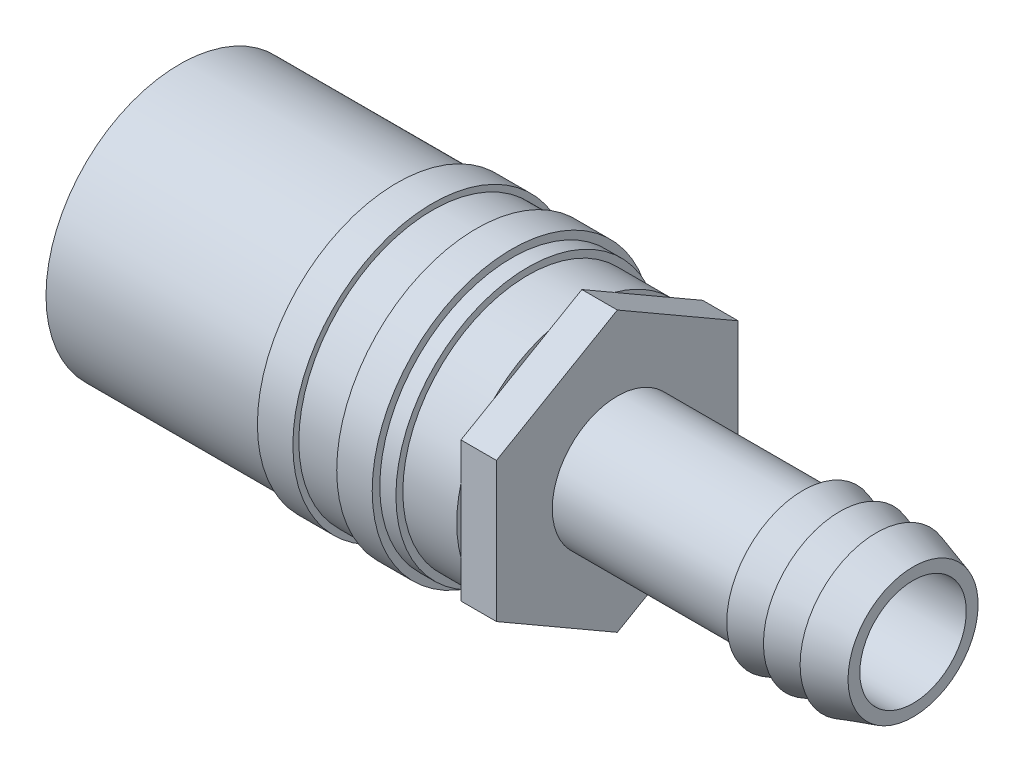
ISO-10303-21;
HEADER;
FILE_DESCRIPTION(('STEP AP214'),'2;1');
FILE_NAME('part.step','',(''),(''),'','','');
FILE_SCHEMA(('AUTOMOTIVE_DESIGN { 1 0 10303 214 1 1 1 1 }'));
ENDSEC;
DATA;
#1=APPLICATION_CONTEXT('core data for automotive mechanical design processes');
#2=APPLICATION_PROTOCOL_DEFINITION('international standard','automotive_design',2000,#1);
#3=PRODUCT_CONTEXT('',#1,'mechanical');
#4=PRODUCT('Part','Part','',(#3));
#5=PRODUCT_RELATED_PRODUCT_CATEGORY('part','',(#4));
#6=PRODUCT_DEFINITION_FORMATION('','',#4);
#7=PRODUCT_DEFINITION_CONTEXT('part definition',#1,'design');
#8=PRODUCT_DEFINITION('design','',#6,#7);
#9=PRODUCT_DEFINITION_SHAPE('','',#8);
#10=(LENGTH_UNIT() NAMED_UNIT(*) SI_UNIT(.MILLI.,.METRE.));
#11=(NAMED_UNIT(*) PLANE_ANGLE_UNIT() SI_UNIT($,.RADIAN.));
#12=(NAMED_UNIT(*) SI_UNIT($,.STERADIAN.) SOLID_ANGLE_UNIT());
#13=UNCERTAINTY_MEASURE_WITH_UNIT(LENGTH_MEASURE(1.E-05),#10,'distance_accuracy_value','');
#14=(GEOMETRIC_REPRESENTATION_CONTEXT(3) GLOBAL_UNCERTAINTY_ASSIGNED_CONTEXT((#13)) GLOBAL_UNIT_ASSIGNED_CONTEXT((#10,
#11,#12)) REPRESENTATION_CONTEXT('',''));
#15=CARTESIAN_POINT('',(0.,0.,0.));
#16=DIRECTION('',(0.,0.,1.));
#17=DIRECTION('',(1.,0.,0.));
#18=AXIS2_PLACEMENT_3D('',#15,#16,#17);
#19=CARTESIAN_POINT('',(34.,6.8,0.));
#20=DIRECTION('',(-1.,0.,0.));
#21=DIRECTION('',(0.,0.,1.));
#22=AXIS2_PLACEMENT_3D('',#19,#20,#21);
#23=PLANE('',#22);
#24=DIRECTION('',(0.,0.5,0.866025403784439));
#25=VECTOR('',#24,1.);
#26=CARTESIAN_POINT('',(34.,5.9,-10.2190997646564));
#27=LINE('',#26,#25);
#28=CARTESIAN_POINT('',(34.,7.48723073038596,-7.46993549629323));
#29=VERTEX_POINT('',#28);
#30=CARTESIAN_POINT('',(34.,10.212769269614,-2.74916426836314));
#31=VERTEX_POINT('',#30);
#32=EDGE_CURVE('P0_E10',#29,#31,#27,.T.);
#33=ORIENTED_EDGE('',*,*,#32,.F.);
#34=CARTESIAN_POINT('',(34.,0.,0.));
#35=DIRECTION('',(-1.,0.,0.));
#36=DIRECTION('',(0.,0.,1.));
#37=AXIS2_PLACEMENT_3D('',#34,#35,#36);
#38=CIRCLE('',#37,10.5763207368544);
#39=EDGE_CURVE('P0_E203',#31,#29,#38,.T.);
#40=ORIENTED_EDGE('',*,*,#39,.F.);
#41=EDGE_LOOP('',(#33,#40));
#42=FACE_BOUND('',#41,.T.);
#43=ADVANCED_FACE('P0_F16',(#42),#23,.F.);
#44=DIRECTION('',(0.,1.,0.));
#45=VECTOR('',#44,1.);
#46=CARTESIAN_POINT('',(34.,-5.9,-10.2190997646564));
#47=LINE('',#46,#45);
#48=CARTESIAN_POINT('',(34.,-2.72553853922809,-10.2190997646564));
#49=VERTEX_POINT('',#48);
#50=CARTESIAN_POINT('',(34.,2.72553853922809,-10.2190997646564));
#51=VERTEX_POINT('',#50);
#52=EDGE_CURVE('P0_E25',#49,#51,#47,.T.);
#53=ORIENTED_EDGE('',*,*,#52,.F.);
#54=EDGE_CURVE('P0_E197',#51,#49,#38,.T.);
#55=ORIENTED_EDGE('',*,*,#54,.F.);
#56=EDGE_LOOP('',(#53,#55));
#57=FACE_BOUND('',#56,.T.);
#58=ADVANCED_FACE('P0_F217',(#57),#23,.F.);
#59=DIRECTION('',(0.,0.5,-0.866025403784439));
#60=VECTOR('',#59,1.);
#61=CARTESIAN_POINT('',(34.,-11.8,0.));
#62=LINE('',#61,#60);
#63=CARTESIAN_POINT('',(34.,-10.212769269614,-2.74916426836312));
#64=VERTEX_POINT('',#63);
#65=CARTESIAN_POINT('',(34.,-7.48723073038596,-7.46993549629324));
#66=VERTEX_POINT('',#65);
#67=EDGE_CURVE('P0_E546',#64,#66,#62,.T.);
#68=ORIENTED_EDGE('',*,*,#67,.F.);
#69=EDGE_CURVE('P0_E191',#66,#64,#38,.T.);
#70=ORIENTED_EDGE('',*,*,#69,.F.);
#71=EDGE_LOOP('',(#68,#70));
#72=FACE_BOUND('',#71,.T.);
#73=ADVANCED_FACE('P0_F224',(#72),#23,.F.);
#74=DIRECTION('',(0.,-0.5,-0.866025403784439));
#75=VECTOR('',#74,1.);
#76=CARTESIAN_POINT('',(34.,-5.9,10.2190997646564));
#77=LINE('',#76,#75);
#78=CARTESIAN_POINT('',(34.,-7.48723073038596,7.46993549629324));
#79=VERTEX_POINT('',#78);
#80=CARTESIAN_POINT('',(34.,-10.212769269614,2.74916426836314));
#81=VERTEX_POINT('',#80);
#82=EDGE_CURVE('P0_E41',#79,#81,#77,.T.);
#83=ORIENTED_EDGE('',*,*,#82,.F.);
#84=EDGE_CURVE('P0_E186',#81,#79,#38,.T.);
#85=ORIENTED_EDGE('',*,*,#84,.F.);
#86=EDGE_LOOP('',(#83,#85));
#87=FACE_BOUND('',#86,.T.);
#88=ADVANCED_FACE('P0_F236',(#87),#23,.F.);
#89=DIRECTION('',(0.,-1.,0.));
#90=VECTOR('',#89,1.);
#91=CARTESIAN_POINT('',(34.,5.9,10.2190997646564));
#92=LINE('',#91,#90);
#93=CARTESIAN_POINT('',(34.,2.72553853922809,10.2190997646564));
#94=VERTEX_POINT('',#93);
#95=CARTESIAN_POINT('',(34.,-2.72553853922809,10.2190997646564));
#96=VERTEX_POINT('',#95);
#97=EDGE_CURVE('P0_E239',#94,#96,#92,.T.);
#98=ORIENTED_EDGE('',*,*,#97,.F.);
#99=EDGE_CURVE('P0_E34',#96,#94,#38,.T.);
#100=ORIENTED_EDGE('',*,*,#99,.F.);
#101=EDGE_LOOP('',(#98,#100));
#102=FACE_BOUND('',#101,.T.);
#103=ADVANCED_FACE('P0_F228',(#102),#23,.F.);
#104=DIRECTION('',(0.,-0.5,0.866025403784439));
#105=VECTOR('',#104,1.);
#106=CARTESIAN_POINT('',(34.,11.8,0.));
#107=LINE('',#106,#105);
#108=CARTESIAN_POINT('',(34.,10.212769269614,2.74916426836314));
#109=VERTEX_POINT('',#108);
#110=CARTESIAN_POINT('',(34.,7.48723073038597,7.46993549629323));
#111=VERTEX_POINT('',#110);
#112=EDGE_CURVE('P0_E183',#109,#111,#107,.T.);
#113=ORIENTED_EDGE('',*,*,#112,.F.);
#114=EDGE_CURVE('P0_E177',#111,#109,#38,.T.);
#115=ORIENTED_EDGE('',*,*,#114,.F.);
#116=EDGE_LOOP('',(#113,#115));
#117=FACE_BOUND('',#116,.T.);
#118=ADVANCED_FACE('P0_F218',(#117),#23,.F.);
#119=CARTESIAN_POINT('',(0.,0.,0.));
#120=DIRECTION('',(-1.,0.,0.));
#121=DIRECTION('',(0.,0.,1.));
#122=AXIS2_PLACEMENT_3D('',#119,#120,#121);
#123=CYLINDRICAL_SURFACE('',#122,6.8);
#124=CARTESIAN_POINT('',(34.,0.,0.));
#125=DIRECTION('',(-1.,0.,0.));
#126=DIRECTION('',(0.,0.,1.));
#127=AXIS2_PLACEMENT_3D('',#124,#125,#126);
#128=CIRCLE('',#127,6.8);
#129=CARTESIAN_POINT('',(34.,0.,6.8));
#130=VERTEX_POINT('',#129);
#131=EDGE_CURVE('P0_E20',#130,#130,#128,.T.);
#132=ORIENTED_EDGE('',*,*,#131,.F.);
#133=EDGE_LOOP('',(#132));
#134=FACE_BOUND('',#133,.T.);
#135=CARTESIAN_POINT('',(0.,0.,0.));
#136=DIRECTION('',(-1.,0.,0.));
#137=DIRECTION('',(0.,0.,1.));
#138=AXIS2_PLACEMENT_3D('',#135,#136,#137);
#139=CIRCLE('',#138,6.8);
#140=CARTESIAN_POINT('',(0.,0.,6.8));
#141=VERTEX_POINT('',#140);
#142=EDGE_CURVE('P0_E136',#141,#141,#139,.T.);
#143=ORIENTED_EDGE('',*,*,#142,.T.);
#144=EDGE_LOOP('',(#143));
#145=FACE_BOUND('',#144,.T.);
#146=ADVANCED_FACE('P0_F18',(#134,#145),#123,.F.);
#147=CARTESIAN_POINT('',(0.,0.,0.));
#148=DIRECTION('',(-1.,0.,0.));
#149=DIRECTION('',(0.,0.,1.));
#150=AXIS2_PLACEMENT_3D('',#147,#148,#149);
#151=CYLINDRICAL_SURFACE('',#150,10.5763207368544);
#152=CARTESIAN_POINT('',(29.4406853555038,0.,0.));
#153=DIRECTION('',(-1.,0.,0.));
#154=DIRECTION('',(0.,0.,1.));
#155=AXIS2_PLACEMENT_3D('',#152,#153,#154);
#156=CIRCLE('',#155,10.5763207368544);
#157=CARTESIAN_POINT('',(29.4406853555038,0.,10.5763207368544));
#158=VERTEX_POINT('',#157);
#159=EDGE_CURVE('P0_E174',#158,#158,#156,.T.);
#160=ORIENTED_EDGE('',*,*,#159,.F.);
#161=EDGE_LOOP('',(#160));
#162=FACE_BOUND('',#161,.T.);
#163=EDGE_CURVE('P0_E176',#94,#111,#38,.T.);
#164=ORIENTED_EDGE('',*,*,#163,.T.);
#165=ORIENTED_EDGE('',*,*,#114,.T.);
#166=EDGE_CURVE('P0_E184',#109,#31,#38,.T.);
#167=ORIENTED_EDGE('',*,*,#166,.T.);
#168=ORIENTED_EDGE('',*,*,#39,.T.);
#169=EDGE_CURVE('P0_E201',#29,#51,#38,.T.);
#170=ORIENTED_EDGE('',*,*,#169,.T.);
#171=ORIENTED_EDGE('',*,*,#54,.T.);
#172=EDGE_CURVE('P0_E195',#49,#66,#38,.T.);
#173=ORIENTED_EDGE('',*,*,#172,.T.);
#174=ORIENTED_EDGE('',*,*,#69,.T.);
#175=EDGE_CURVE('P0_E189',#64,#81,#38,.T.);
#176=ORIENTED_EDGE('',*,*,#175,.T.);
#177=ORIENTED_EDGE('',*,*,#84,.T.);
#178=EDGE_CURVE('P0_E185',#79,#96,#38,.T.);
#179=ORIENTED_EDGE('',*,*,#178,.T.);
#180=ORIENTED_EDGE('',*,*,#99,.T.);
#181=EDGE_LOOP('',(#164,#165,#167,#168,#170,#171,#173,#174,#176,#177,#179,#180));
#182=FACE_BOUND('',#181,.T.);
#183=ADVANCED_FACE('P0_F209',(#162,#182),#151,.T.);
#184=CARTESIAN_POINT('',(29.4406853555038,11.1600845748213,0.));
#185=DIRECTION('',(-1.,0.,0.));
#186=DIRECTION('',(0.,0.,1.));
#187=AXIS2_PLACEMENT_3D('',#184,#185,#186);
#188=PLANE('',#187);
#189=CARTESIAN_POINT('',(29.4406853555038,0.,0.));
#190=DIRECTION('',(-1.,0.,0.));
#191=DIRECTION('',(0.,0.,1.));
#192=AXIS2_PLACEMENT_3D('',#189,#190,#191);
#193=CIRCLE('',#192,11.1600845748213);
#194=CARTESIAN_POINT('',(29.4406853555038,0.,11.1600845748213));
#195=VERTEX_POINT('',#194);
#196=EDGE_CURVE('P0_E171',#195,#195,#193,.T.);
#197=ORIENTED_EDGE('',*,*,#196,.F.);
#198=EDGE_LOOP('',(#197));
#199=FACE_BOUND('',#198,.T.);
#200=ORIENTED_EDGE('',*,*,#159,.T.);
#201=EDGE_LOOP('',(#200));
#202=FACE_BOUND('',#201,.T.);
#203=ADVANCED_FACE('P0_F337',(#199,#202),#188,.F.);
#204=CARTESIAN_POINT('',(0.,0.,0.));
#205=DIRECTION('',(-1.,0.,0.));
#206=DIRECTION('',(0.,0.,1.));
#207=AXIS2_PLACEMENT_3D('',#204,#205,#206);
#208=CYLINDRICAL_SURFACE('',#207,11.1600845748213);
#209=CARTESIAN_POINT('',(28.0769611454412,0.,0.));
#210=DIRECTION('',(-1.,0.,0.));
#211=DIRECTION('',(0.,0.,1.));
#212=AXIS2_PLACEMENT_3D('',#209,#210,#211);
#213=CIRCLE('',#212,11.1600845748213);
#214=CARTESIAN_POINT('',(28.0769611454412,0.,11.1600845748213));
#215=VERTEX_POINT('',#214);
#216=EDGE_CURVE('P0_E168',#215,#215,#213,.T.);
#217=ORIENTED_EDGE('',*,*,#216,.F.);
#218=EDGE_LOOP('',(#217));
#219=FACE_BOUND('',#218,.T.);
#220=ORIENTED_EDGE('',*,*,#196,.T.);
#221=EDGE_LOOP('',(#220));
#222=FACE_BOUND('',#221,.T.);
#223=ADVANCED_FACE('P0_F333',(#219,#222),#208,.T.);
#224=CARTESIAN_POINT('',(28.0769611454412,11.8,0.));
#225=DIRECTION('',(-1.,0.,0.));
#226=DIRECTION('',(0.,0.,1.));
#227=AXIS2_PLACEMENT_3D('',#224,#225,#226);
#228=PLANE('',#227);
#229=CARTESIAN_POINT('',(28.0769611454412,0.,0.));
#230=DIRECTION('',(-1.,0.,0.));
#231=DIRECTION('',(0.,0.,1.));
#232=AXIS2_PLACEMENT_3D('',#229,#230,#231);
#233=CIRCLE('',#232,11.8);
#234=CARTESIAN_POINT('',(28.0769611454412,0.,11.8));
#235=VERTEX_POINT('',#234);
#236=EDGE_CURVE('P0_E165',#235,#235,#233,.T.);
#237=ORIENTED_EDGE('',*,*,#236,.F.);
#238=EDGE_LOOP('',(#237));
#239=FACE_BOUND('',#238,.T.);
#240=ORIENTED_EDGE('',*,*,#216,.T.);
#241=EDGE_LOOP('',(#240));
#242=FACE_BOUND('',#241,.T.);
#243=ADVANCED_FACE('P0_F329',(#239,#242),#228,.F.);
#244=CARTESIAN_POINT('',(0.,0.,0.));
#245=DIRECTION('',(-1.,0.,0.));
#246=DIRECTION('',(0.,0.,1.));
#247=AXIS2_PLACEMENT_3D('',#244,#245,#246);
#248=CYLINDRICAL_SURFACE('',#247,11.8);
#249=CARTESIAN_POINT('',(25.0769611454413,0.,0.));
#250=DIRECTION('',(-1.,0.,0.));
#251=DIRECTION('',(0.,0.,1.));
#252=AXIS2_PLACEMENT_3D('',#249,#250,#251);
#253=CIRCLE('',#252,11.8);
#254=CARTESIAN_POINT('',(25.0769611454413,0.,11.8));
#255=VERTEX_POINT('',#254);
#256=EDGE_CURVE('P0_E162',#255,#255,#253,.T.);
#257=ORIENTED_EDGE('',*,*,#256,.F.);
#258=EDGE_LOOP('',(#257));
#259=FACE_BOUND('',#258,.T.);
#260=ORIENTED_EDGE('',*,*,#236,.T.);
#261=EDGE_LOOP('',(#260));
#262=FACE_BOUND('',#261,.T.);
#263=ADVANCED_FACE('P0_F325',(#259,#262),#248,.T.);
#264=CARTESIAN_POINT('',(25.0769611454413,11.3,0.));
#265=DIRECTION('',(1.,0.,0.));
#266=DIRECTION('',(0.,0.,-1.));
#267=AXIS2_PLACEMENT_3D('',#264,#265,#266);
#268=PLANE('',#267);
#269=CARTESIAN_POINT('',(25.0769611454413,0.,0.));
#270=DIRECTION('',(-1.,0.,0.));
#271=DIRECTION('',(0.,0.,1.));
#272=AXIS2_PLACEMENT_3D('',#269,#270,#271);
#273=CIRCLE('',#272,11.3);
#274=CARTESIAN_POINT('',(25.0769611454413,0.,11.3));
#275=VERTEX_POINT('',#274);
#276=EDGE_CURVE('P0_E159',#275,#275,#273,.T.);
#277=ORIENTED_EDGE('',*,*,#276,.F.);
#278=EDGE_LOOP('',(#277));
#279=FACE_BOUND('',#278,.T.);
#280=ORIENTED_EDGE('',*,*,#256,.T.);
#281=EDGE_LOOP('',(#280));
#282=FACE_BOUND('',#281,.T.);
#283=ADVANCED_FACE('P0_F321',(#279,#282),#268,.F.);
#284=CARTESIAN_POINT('',(0.,0.,0.));
#285=DIRECTION('',(-1.,0.,0.));
#286=DIRECTION('',(0.,0.,1.));
#287=AXIS2_PLACEMENT_3D('',#284,#285,#286);
#288=CYLINDRICAL_SURFACE('',#287,11.3);
#289=CARTESIAN_POINT('',(21.3716105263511,0.,0.));
#290=DIRECTION('',(-1.,0.,0.));
#291=DIRECTION('',(0.,0.,1.));
#292=AXIS2_PLACEMENT_3D('',#289,#290,#291);
#293=CIRCLE('',#292,11.3);
#294=CARTESIAN_POINT('',(21.3716105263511,0.,11.3));
#295=VERTEX_POINT('',#294);
#296=EDGE_CURVE('P0_E156',#295,#295,#293,.T.);
#297=ORIENTED_EDGE('',*,*,#296,.F.);
#298=EDGE_LOOP('',(#297));
#299=FACE_BOUND('',#298,.T.);
#300=ORIENTED_EDGE('',*,*,#276,.T.);
#301=EDGE_LOOP('',(#300));
#302=FACE_BOUND('',#301,.T.);
#303=ADVANCED_FACE('P0_F317',(#299,#302),#288,.T.);
#304=CARTESIAN_POINT('',(21.3716105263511,11.8,0.));
#305=DIRECTION('',(-1.,0.,0.));
#306=DIRECTION('',(0.,0.,1.));
#307=AXIS2_PLACEMENT_3D('',#304,#305,#306);
#308=PLANE('',#307);
#309=CARTESIAN_POINT('',(21.3716105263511,0.,0.));
#310=DIRECTION('',(-1.,0.,0.));
#311=DIRECTION('',(0.,0.,1.));
#312=AXIS2_PLACEMENT_3D('',#309,#310,#311);
#313=CIRCLE('',#312,11.8);
#314=CARTESIAN_POINT('',(21.3716105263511,0.,11.8));
#315=VERTEX_POINT('',#314);
#316=EDGE_CURVE('P0_E153',#315,#315,#313,.T.);
#317=ORIENTED_EDGE('',*,*,#316,.F.);
#318=EDGE_LOOP('',(#317));
#319=FACE_BOUND('',#318,.T.);
#320=ORIENTED_EDGE('',*,*,#296,.T.);
#321=EDGE_LOOP('',(#320));
#322=FACE_BOUND('',#321,.T.);
#323=ADVANCED_FACE('P0_F313',(#319,#322),#308,.F.);
#324=CARTESIAN_POINT('',(0.,0.,0.));
#325=DIRECTION('',(-1.,0.,0.));
#326=DIRECTION('',(0.,0.,1.));
#327=AXIS2_PLACEMENT_3D('',#324,#325,#326);
#328=CYLINDRICAL_SURFACE('',#327,11.8);
#329=CARTESIAN_POINT('',(18.3716105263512,0.,0.));
#330=DIRECTION('',(-1.,0.,0.));
#331=DIRECTION('',(0.,0.,1.));
#332=AXIS2_PLACEMENT_3D('',#329,#330,#331);
#333=CIRCLE('',#332,11.8);
#334=CARTESIAN_POINT('',(18.3716105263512,0.,11.8));
#335=VERTEX_POINT('',#334);
#336=EDGE_CURVE('P0_E150',#335,#335,#333,.T.);
#337=ORIENTED_EDGE('',*,*,#336,.F.);
#338=EDGE_LOOP('',(#337));
#339=FACE_BOUND('',#338,.T.);
#340=ORIENTED_EDGE('',*,*,#316,.T.);
#341=EDGE_LOOP('',(#340));
#342=FACE_BOUND('',#341,.T.);
#343=ADVANCED_FACE('P0_F309',(#339,#342),#328,.T.);
#344=CARTESIAN_POINT('',(18.3716105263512,11.3,0.));
#345=DIRECTION('',(1.,0.,0.));
#346=DIRECTION('',(0.,0.,-1.));
#347=AXIS2_PLACEMENT_3D('',#344,#345,#346);
#348=PLANE('',#347);
#349=CARTESIAN_POINT('',(18.3716105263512,0.,0.));
#350=DIRECTION('',(-1.,0.,0.));
#351=DIRECTION('',(0.,0.,1.));
#352=AXIS2_PLACEMENT_3D('',#349,#350,#351);
#353=CIRCLE('',#352,11.3);
#354=CARTESIAN_POINT('',(18.3716105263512,0.,11.3));
#355=VERTEX_POINT('',#354);
#356=EDGE_CURVE('P0_E147',#355,#355,#353,.T.);
#357=ORIENTED_EDGE('',*,*,#356,.F.);
#358=EDGE_LOOP('',(#357));
#359=FACE_BOUND('',#358,.T.);
#360=ORIENTED_EDGE('',*,*,#336,.T.);
#361=EDGE_LOOP('',(#360));
#362=FACE_BOUND('',#361,.T.);
#363=ADVANCED_FACE('P0_F305',(#359,#362),#348,.F.);
#364=CARTESIAN_POINT('',(0.,0.,0.));
#365=DIRECTION('',(-1.,0.,0.));
#366=DIRECTION('',(0.,0.,1.));
#367=AXIS2_PLACEMENT_3D('',#364,#365,#366);
#368=CYLINDRICAL_SURFACE('',#367,11.3);
#369=CARTESIAN_POINT('',(0.,0.,0.));
#370=DIRECTION('',(-1.,0.,0.));
#371=DIRECTION('',(0.,0.,1.));
#372=AXIS2_PLACEMENT_3D('',#369,#370,#371);
#373=CIRCLE('',#372,11.3);
#374=CARTESIAN_POINT('',(0.,0.,11.3));
#375=VERTEX_POINT('',#374);
#376=EDGE_CURVE('P0_E139',#375,#375,#373,.T.);
#377=ORIENTED_EDGE('',*,*,#376,.F.);
#378=EDGE_LOOP('',(#377));
#379=FACE_BOUND('',#378,.T.);
#380=ORIENTED_EDGE('',*,*,#356,.T.);
#381=EDGE_LOOP('',(#380));
#382=FACE_BOUND('',#381,.T.);
#383=ADVANCED_FACE('P0_F301',(#379,#382),#368,.T.);
#384=CARTESIAN_POINT('',(0.,6.8,0.));
#385=DIRECTION('',(1.,0.,0.));
#386=DIRECTION('',(0.,0.,-1.));
#387=AXIS2_PLACEMENT_3D('',#384,#385,#386);
#388=PLANE('',#387);
#389=ORIENTED_EDGE('',*,*,#142,.F.);
#390=EDGE_LOOP('',(#389));
#391=FACE_BOUND('',#390,.T.);
#392=ORIENTED_EDGE('',*,*,#376,.T.);
#393=EDGE_LOOP('',(#392));
#394=FACE_BOUND('',#393,.T.);
#395=ADVANCED_FACE('P0_F298',(#391,#394),#388,.F.);
#396=CARTESIAN_POINT('',(34.,0.,0.));
#397=DIRECTION('',(1.,0.,0.));
#398=DIRECTION('',(0.,0.,-1.));
#399=AXIS2_PLACEMENT_3D('',#396,#397,#398);
#400=PLANE('',#399);
#401=ORIENTED_EDGE('',*,*,#163,.F.);
#402=CARTESIAN_POINT('',(34.,5.9,10.2190997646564));
#403=VERTEX_POINT('',#402);
#404=EDGE_CURVE('P0_E244',#403,#94,#92,.T.);
#405=ORIENTED_EDGE('',*,*,#404,.F.);
#406=EDGE_CURVE('P0_E241',#111,#403,#107,.T.);
#407=ORIENTED_EDGE('',*,*,#406,.F.);
#408=EDGE_LOOP('',(#401,#405,#407));
#409=FACE_BOUND('',#408,.T.);
#410=ADVANCED_FACE('P0_F273',(#409),#400,.F.);
#411=ORIENTED_EDGE('',*,*,#166,.F.);
#412=CARTESIAN_POINT('',(34.,11.8,0.));
#413=VERTEX_POINT('',#412);
#414=EDGE_CURVE('P0_E212',#413,#109,#107,.T.);
#415=ORIENTED_EDGE('',*,*,#414,.F.);
#416=EDGE_CURVE('P0_E28',#31,#413,#27,.T.);
#417=ORIENTED_EDGE('',*,*,#416,.F.);
#418=EDGE_LOOP('',(#411,#415,#417));
#419=FACE_BOUND('',#418,.T.);
#420=ADVANCED_FACE('P0_F211',(#419),#400,.F.);
#421=ORIENTED_EDGE('',*,*,#169,.F.);
#422=CARTESIAN_POINT('',(34.,5.9,-10.2190997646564));
#423=VERTEX_POINT('',#422);
#424=EDGE_CURVE('P0_E27',#423,#29,#27,.T.);
#425=ORIENTED_EDGE('',*,*,#424,.F.);
#426=EDGE_CURVE('P0_E553',#51,#423,#47,.T.);
#427=ORIENTED_EDGE('',*,*,#426,.F.);
#428=EDGE_LOOP('',(#421,#425,#427));
#429=FACE_BOUND('',#428,.T.);
#430=ADVANCED_FACE('P0_F424',(#429),#400,.F.);
#431=ORIENTED_EDGE('',*,*,#172,.F.);
#432=CARTESIAN_POINT('',(34.,-5.9,-10.2190997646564));
#433=VERTEX_POINT('',#432);
#434=EDGE_CURVE('P0_E130',#433,#49,#47,.T.);
#435=ORIENTED_EDGE('',*,*,#434,.F.);
#436=EDGE_CURVE('P0_E550',#66,#433,#62,.T.);
#437=ORIENTED_EDGE('',*,*,#436,.F.);
#438=EDGE_LOOP('',(#431,#435,#437));
#439=FACE_BOUND('',#438,.T.);
#440=ADVANCED_FACE('P0_F431',(#439),#400,.F.);
#441=ORIENTED_EDGE('',*,*,#175,.F.);
#442=CARTESIAN_POINT('',(34.,-11.8,0.));
#443=VERTEX_POINT('',#442);
#444=EDGE_CURVE('P0_E549',#443,#64,#62,.T.);
#445=ORIENTED_EDGE('',*,*,#444,.F.);
#446=EDGE_CURVE('P0_E556',#81,#443,#77,.T.);
#447=ORIENTED_EDGE('',*,*,#446,.F.);
#448=EDGE_LOOP('',(#441,#445,#447));
#449=FACE_BOUND('',#448,.T.);
#450=ADVANCED_FACE('P0_F274',(#449),#400,.F.);
#451=CARTESIAN_POINT('',(34.,0.,0.));
#452=DIRECTION('',(1.,0.,0.));
#453=DIRECTION('',(0.,0.,-1.));
#454=AXIS2_PLACEMENT_3D('',#451,#452,#453);
#455=CIRCLE('',#454,4.75);
#456=CARTESIAN_POINT('',(34.,0.,-4.75));
#457=VERTEX_POINT('',#456);
#458=EDGE_CURVE('P0_E254',#457,#457,#455,.T.);
#459=ORIENTED_EDGE('',*,*,#458,.T.);
#460=EDGE_LOOP('',(#459));
#461=FACE_BOUND('',#460,.T.);
#462=ORIENTED_EDGE('',*,*,#131,.T.);
#463=EDGE_LOOP('',(#462));
#464=FACE_BOUND('',#463,.T.);
#465=ADVANCED_FACE('P0_F264',(#461,#464),#400,.F.);
#466=CARTESIAN_POINT('',(37.,0.,0.));
#467=DIRECTION('',(1.,0.,0.));
#468=DIRECTION('',(0.,0.,-1.));
#469=AXIS2_PLACEMENT_3D('',#466,#467,#468);
#470=PLANE('',#469);
#471=DIRECTION('',(0.,0.5,0.866025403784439));
#472=VECTOR('',#471,1.);
#473=CARTESIAN_POINT('',(37.,5.9,-10.2190997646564));
#474=LINE('',#473,#472);
#475=CARTESIAN_POINT('',(37.,5.9,-10.2190997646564));
#476=VERTEX_POINT('',#475);
#477=CARTESIAN_POINT('',(37.,11.8,0.));
#478=VERTEX_POINT('',#477);
#479=EDGE_CURVE('P0_E120',#476,#478,#474,.T.);
#480=ORIENTED_EDGE('',*,*,#479,.T.);
#481=DIRECTION('',(0.,-0.5,0.866025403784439));
#482=VECTOR('',#481,1.);
#483=CARTESIAN_POINT('',(37.,11.8,0.));
#484=LINE('',#483,#482);
#485=CARTESIAN_POINT('',(37.,5.9,10.2190997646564));
#486=VERTEX_POINT('',#485);
#487=EDGE_CURVE('P0_E109',#478,#486,#484,.T.);
#488=ORIENTED_EDGE('',*,*,#487,.T.);
#489=DIRECTION('',(0.,-1.,0.));
#490=VECTOR('',#489,1.);
#491=CARTESIAN_POINT('',(37.,5.9,10.2190997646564));
#492=LINE('',#491,#490);
#493=CARTESIAN_POINT('',(37.,-5.9,10.2190997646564));
#494=VERTEX_POINT('',#493);
#495=EDGE_CURVE('P0_E119',#486,#494,#492,.T.);
#496=ORIENTED_EDGE('',*,*,#495,.T.);
#497=DIRECTION('',(0.,-0.5,-0.866025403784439));
#498=VECTOR('',#497,1.);
#499=CARTESIAN_POINT('',(37.,-5.9,10.2190997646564));
#500=LINE('',#499,#498);
#501=CARTESIAN_POINT('',(37.,-11.8,0.));
#502=VERTEX_POINT('',#501);
#503=EDGE_CURVE('P0_E251',#494,#502,#500,.T.);
#504=ORIENTED_EDGE('',*,*,#503,.T.);
#505=DIRECTION('',(0.,0.5,-0.866025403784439));
#506=VECTOR('',#505,1.);
#507=CARTESIAN_POINT('',(37.,-11.8,0.));
#508=LINE('',#507,#506);
#509=CARTESIAN_POINT('',(37.,-5.9,-10.2190997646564));
#510=VERTEX_POINT('',#509);
#511=EDGE_CURVE('P0_E249',#502,#510,#508,.T.);
#512=ORIENTED_EDGE('',*,*,#511,.T.);
#513=DIRECTION('',(0.,1.,0.));
#514=VECTOR('',#513,1.);
#515=CARTESIAN_POINT('',(37.,-5.9,-10.2190997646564));
#516=LINE('',#515,#514);
#517=EDGE_CURVE('P0_E126',#510,#476,#516,.T.);
#518=ORIENTED_EDGE('',*,*,#517,.T.);
#519=EDGE_LOOP('',(#480,#488,#496,#504,#512,#518));
#520=FACE_BOUND('',#519,.T.);
#521=CARTESIAN_POINT('',(37.,0.,0.));
#522=DIRECTION('',(1.,0.,0.));
#523=DIRECTION('',(0.,0.,-1.));
#524=AXIS2_PLACEMENT_3D('',#521,#522,#523);
#525=CIRCLE('',#524,4.75);
#526=CARTESIAN_POINT('',(37.,0.,-4.75));
#527=VERTEX_POINT('',#526);
#528=EDGE_CURVE('P0_E213',#527,#527,#525,.T.);
#529=ORIENTED_EDGE('',*,*,#528,.F.);
#530=EDGE_LOOP('',(#529));
#531=FACE_BOUND('',#530,.T.);
#532=ADVANCED_FACE('P0_F123',(#520,#531),#470,.T.);
#533=ORIENTED_EDGE('',*,*,#178,.F.);
#534=CARTESIAN_POINT('',(34.,-5.9,10.2190997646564));
#535=VERTEX_POINT('',#534);
#536=EDGE_CURVE('P0_E555',#535,#79,#77,.T.);
#537=ORIENTED_EDGE('',*,*,#536,.F.);
#538=EDGE_CURVE('P0_E245',#96,#535,#92,.T.);
#539=ORIENTED_EDGE('',*,*,#538,.F.);
#540=EDGE_LOOP('',(#533,#537,#539));
#541=FACE_BOUND('',#540,.T.);
#542=ADVANCED_FACE('P0_F263',(#541),#400,.F.);
#543=CARTESIAN_POINT('',(37.,5.9,-10.2190997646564));
#544=DIRECTION('',(0.,-0.866025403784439,0.5));
#545=DIRECTION('',(0.,-0.5,-0.866025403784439));
#546=AXIS2_PLACEMENT_3D('',#543,#544,#545);
#547=PLANE('',#546);
#548=ORIENTED_EDGE('',*,*,#424,.T.);
#549=ORIENTED_EDGE('',*,*,#32,.T.);
#550=ORIENTED_EDGE('',*,*,#416,.T.);
#551=DIRECTION('',(-1.,0.,0.));
#552=VECTOR('',#551,1.);
#553=CARTESIAN_POINT('',(37.,11.8,0.));
#554=LINE('',#553,#552);
#555=EDGE_CURVE('P0_E114',#478,#413,#554,.T.);
#556=ORIENTED_EDGE('',*,*,#555,.F.);
#557=ORIENTED_EDGE('',*,*,#479,.F.);
#558=DIRECTION('',(-1.,0.,0.));
#559=VECTOR('',#558,1.);
#560=CARTESIAN_POINT('',(37.,5.9,-10.2190997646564));
#561=LINE('',#560,#559);
#562=EDGE_CURVE('P0_E248',#476,#423,#561,.T.);
#563=ORIENTED_EDGE('',*,*,#562,.T.);
#564=EDGE_LOOP('',(#548,#549,#550,#556,#557,#563));
#565=FACE_BOUND('',#564,.T.);
#566=ADVANCED_FACE('P0_F133',(#565),#547,.F.);
#567=CARTESIAN_POINT('',(37.,11.8,0.));
#568=DIRECTION('',(0.,-0.866025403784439,-0.5));
#569=DIRECTION('',(0.,0.5,-0.866025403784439));
#570=AXIS2_PLACEMENT_3D('',#567,#568,#569);
#571=PLANE('',#570);
#572=ORIENTED_EDGE('',*,*,#414,.T.);
#573=ORIENTED_EDGE('',*,*,#112,.T.);
#574=ORIENTED_EDGE('',*,*,#406,.T.);
#575=DIRECTION('',(-1.,0.,0.));
#576=VECTOR('',#575,1.);
#577=CARTESIAN_POINT('',(37.,5.9,10.2190997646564));
#578=LINE('',#577,#576);
#579=EDGE_CURVE('P0_E116',#486,#403,#578,.T.);
#580=ORIENTED_EDGE('',*,*,#579,.F.);
#581=ORIENTED_EDGE('',*,*,#487,.F.);
#582=ORIENTED_EDGE('',*,*,#555,.T.);
#583=EDGE_LOOP('',(#572,#573,#574,#580,#581,#582));
#584=FACE_BOUND('',#583,.T.);
#585=ADVANCED_FACE('P0_F112',(#584),#571,.F.);
#586=CARTESIAN_POINT('',(37.,5.9,10.2190997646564));
#587=DIRECTION('',(0.,0.,-1.));
#588=DIRECTION('',(-1.,0.,0.));
#589=AXIS2_PLACEMENT_3D('',#586,#587,#588);
#590=PLANE('',#589);
#591=ORIENTED_EDGE('',*,*,#404,.T.);
#592=ORIENTED_EDGE('',*,*,#97,.T.);
#593=ORIENTED_EDGE('',*,*,#538,.T.);
#594=DIRECTION('',(-1.,0.,0.));
#595=VECTOR('',#594,1.);
#596=CARTESIAN_POINT('',(37.,-5.9,10.2190997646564));
#597=LINE('',#596,#595);
#598=EDGE_CURVE('P0_E141',#494,#535,#597,.T.);
#599=ORIENTED_EDGE('',*,*,#598,.F.);
#600=ORIENTED_EDGE('',*,*,#495,.F.);
#601=ORIENTED_EDGE('',*,*,#579,.T.);
#602=EDGE_LOOP('',(#591,#592,#593,#599,#600,#601));
#603=FACE_BOUND('',#602,.T.);
#604=ADVANCED_FACE('P0_F289',(#603),#590,.F.);
#605=CARTESIAN_POINT('',(37.,-5.9,10.2190997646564));
#606=DIRECTION('',(0.,0.866025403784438,-0.5));
#607=DIRECTION('',(0.,0.5,0.866025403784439));
#608=AXIS2_PLACEMENT_3D('',#605,#606,#607);
#609=PLANE('',#608);
#610=ORIENTED_EDGE('',*,*,#536,.T.);
#611=ORIENTED_EDGE('',*,*,#82,.T.);
#612=ORIENTED_EDGE('',*,*,#446,.T.);
#613=DIRECTION('',(-1.,0.,0.));
#614=VECTOR('',#613,1.);
#615=CARTESIAN_POINT('',(37.,-11.8,0.));
#616=LINE('',#615,#614);
#617=EDGE_CURVE('P0_E567',#502,#443,#616,.T.);
#618=ORIENTED_EDGE('',*,*,#617,.F.);
#619=ORIENTED_EDGE('',*,*,#503,.F.);
#620=ORIENTED_EDGE('',*,*,#598,.T.);
#621=EDGE_LOOP('',(#610,#611,#612,#618,#619,#620));
#622=FACE_BOUND('',#621,.T.);
#623=ADVANCED_FACE('P0_F285',(#622),#609,.F.);
#624=CARTESIAN_POINT('',(37.,-11.8,0.));
#625=DIRECTION('',(0.,0.866025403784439,0.5));
#626=DIRECTION('',(0.,-0.5,0.866025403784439));
#627=AXIS2_PLACEMENT_3D('',#624,#625,#626);
#628=PLANE('',#627);
#629=ORIENTED_EDGE('',*,*,#444,.T.);
#630=ORIENTED_EDGE('',*,*,#67,.T.);
#631=ORIENTED_EDGE('',*,*,#436,.T.);
#632=DIRECTION('',(-1.,0.,0.));
#633=VECTOR('',#632,1.);
#634=CARTESIAN_POINT('',(37.,-5.9,-10.2190997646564));
#635=LINE('',#634,#633);
#636=EDGE_CURVE('P0_E569',#510,#433,#635,.T.);
#637=ORIENTED_EDGE('',*,*,#636,.F.);
#638=ORIENTED_EDGE('',*,*,#511,.F.);
#639=ORIENTED_EDGE('',*,*,#617,.T.);
#640=EDGE_LOOP('',(#629,#630,#631,#637,#638,#639));
#641=FACE_BOUND('',#640,.T.);
#642=ADVANCED_FACE('P0_F281',(#641),#628,.F.);
#643=CARTESIAN_POINT('',(37.,-5.9,-10.2190997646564));
#644=DIRECTION('',(0.,0.,1.));
#645=DIRECTION('',(1.,0.,0.));
#646=AXIS2_PLACEMENT_3D('',#643,#644,#645);
#647=PLANE('',#646);
#648=ORIENTED_EDGE('',*,*,#434,.T.);
#649=ORIENTED_EDGE('',*,*,#52,.T.);
#650=ORIENTED_EDGE('',*,*,#426,.T.);
#651=ORIENTED_EDGE('',*,*,#562,.F.);
#652=ORIENTED_EDGE('',*,*,#517,.F.);
#653=ORIENTED_EDGE('',*,*,#636,.T.);
#654=EDGE_LOOP('',(#648,#649,#650,#651,#652,#653));
#655=FACE_BOUND('',#654,.T.);
#656=ADVANCED_FACE('P0_F278',(#655),#647,.F.);
#657=CARTESIAN_POINT('',(37.,0.,0.));
#658=DIRECTION('',(-1.,0.,0.));
#659=DIRECTION('',(0.,0.,1.));
#660=AXIS2_PLACEMENT_3D('',#657,#658,#659);
#661=CYLINDRICAL_SURFACE('',#660,4.75);
#662=ORIENTED_EDGE('',*,*,#528,.T.);
#663=EDGE_LOOP('',(#662));
#664=FACE_BOUND('',#663,.T.);
#665=ORIENTED_EDGE('',*,*,#458,.F.);
#666=EDGE_LOOP('',(#665));
#667=FACE_BOUND('',#666,.T.);
#668=ADVANCED_FACE('P0_F260',(#664,#667),#661,.F.);
#669=CLOSED_SHELL('',(#43,#58,#73,#88,#103,#118,#146,#183,#203,#223,#243,#263,#283,#303,#323,
#343,#363,#383,#395,#410,#420,#430,#440,#450,#465,#532,#542,#566,#585,#604,#623,#642,#656,#668));
#670=MANIFOLD_SOLID_BREP('P0_B1',#669);
#671=CARTESIAN_POINT('',(37.,0.,-5.5));
#672=DIRECTION('',(1.,0.,0.));
#673=DIRECTION('',(0.,0.,-1.));
#674=AXIS2_PLACEMENT_3D('',#671,#672,#673);
#675=PLANE('',#674);
#676=CARTESIAN_POINT('',(37.,0.,0.));
#677=DIRECTION('',(-1.,0.,0.));
#678=DIRECTION('',(0.,0.,1.));
#679=AXIS2_PLACEMENT_3D('',#676,#677,#678);
#680=CIRCLE('',#679,4.5);
#681=CARTESIAN_POINT('',(37.,0.,4.5));
#682=VERTEX_POINT('',#681);
#683=EDGE_CURVE('P1_E9',#682,#682,#680,.T.);
#684=ORIENTED_EDGE('',*,*,#683,.F.);
#685=EDGE_LOOP('',(#684));
#686=FACE_BOUND('',#685,.T.);
#687=CARTESIAN_POINT('',(37.,0.,0.));
#688=DIRECTION('',(-1.,0.,0.));
#689=DIRECTION('',(0.,0.,1.));
#690=AXIS2_PLACEMENT_3D('',#687,#688,#689);
#691=CIRCLE('',#690,5.5);
#692=CARTESIAN_POINT('',(37.,0.,5.5));
#693=VERTEX_POINT('',#692);
#694=EDGE_CURVE('P1_E48',#693,#693,#691,.T.);
#695=ORIENTED_EDGE('',*,*,#694,.T.);
#696=EDGE_LOOP('',(#695));
#697=FACE_BOUND('',#696,.T.);
#698=ADVANCED_FACE('P1_F14',(#686,#697),#675,.F.);
#699=CARTESIAN_POINT('',(0.,0.,0.));
#700=DIRECTION('',(-1.,0.,0.));
#701=DIRECTION('',(0.,0.,1.));
#702=AXIS2_PLACEMENT_3D('',#699,#700,#701);
#703=CYLINDRICAL_SURFACE('',#702,4.5);
#704=CARTESIAN_POINT('',(62.,0.,0.));
#705=DIRECTION('',(-1.,0.,0.));
#706=DIRECTION('',(0.,0.,1.));
#707=AXIS2_PLACEMENT_3D('',#704,#705,#706);
#708=CIRCLE('',#707,4.5);
#709=CARTESIAN_POINT('',(62.,0.,4.5));
#710=VERTEX_POINT('',#709);
#711=EDGE_CURVE('P1_E20',#710,#710,#708,.T.);
#712=ORIENTED_EDGE('',*,*,#711,.F.);
#713=EDGE_LOOP('',(#712));
#714=FACE_BOUND('',#713,.T.);
#715=ORIENTED_EDGE('',*,*,#683,.T.);
#716=EDGE_LOOP('',(#715));
#717=FACE_BOUND('',#716,.T.);
#718=ADVANCED_FACE('P1_F97',(#714,#717),#703,.F.);
#719=CARTESIAN_POINT('',(62.,0.,-4.5));
#720=DIRECTION('',(-1.,0.,0.));
#721=DIRECTION('',(0.,0.,1.));
#722=AXIS2_PLACEMENT_3D('',#719,#720,#721);
#723=PLANE('',#722);
#724=CARTESIAN_POINT('',(62.,0.,0.));
#725=DIRECTION('',(-1.,0.,0.));
#726=DIRECTION('',(0.,0.,1.));
#727=AXIS2_PLACEMENT_3D('',#724,#725,#726);
#728=CIRCLE('',#727,5.5);
#729=CARTESIAN_POINT('',(62.,0.,5.5));
#730=VERTEX_POINT('',#729);
#731=EDGE_CURVE('P1_E24',#730,#730,#728,.T.);
#732=ORIENTED_EDGE('',*,*,#731,.F.);
#733=EDGE_LOOP('',(#732));
#734=FACE_BOUND('',#733,.T.);
#735=ORIENTED_EDGE('',*,*,#711,.T.);
#736=EDGE_LOOP('',(#735));
#737=FACE_BOUND('',#736,.T.);
#738=ADVANCED_FACE('P1_F92',(#734,#737),#723,.F.);
#739=CARTESIAN_POINT('',(62.,0.,0.));
#740=DIRECTION('',(-1.,0.,0.));
#741=DIRECTION('',(0.,0.,1.));
#742=AXIS2_PLACEMENT_3D('',#739,#740,#741);
#743=CONICAL_SURFACE('',#742,5.5,0.297176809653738);
#744=CARTESIAN_POINT('',(58.8994986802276,0.,0.));
#745=DIRECTION('',(-1.,0.,0.));
#746=DIRECTION('',(0.,0.,1.));
#747=AXIS2_PLACEMENT_3D('',#744,#745,#746);
#748=CIRCLE('',#747,6.44951489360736);
#749=CARTESIAN_POINT('',(58.8994986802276,0.,6.44951489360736));
#750=VERTEX_POINT('',#749);
#751=EDGE_CURVE('P1_E28',#750,#750,#748,.T.);
#752=ORIENTED_EDGE('',*,*,#751,.F.);
#753=EDGE_LOOP('',(#752));
#754=FACE_BOUND('',#753,.T.);
#755=ORIENTED_EDGE('',*,*,#731,.T.);
#756=EDGE_LOOP('',(#755));
#757=FACE_BOUND('',#756,.T.);
#758=ADVANCED_FACE('P1_F86',(#754,#757),#743,.T.);
#759=CARTESIAN_POINT('',(58.8994986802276,0.,-6.44951489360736));
#760=DIRECTION('',(1.,0.,0.));
#761=DIRECTION('',(0.,0.,-1.));
#762=AXIS2_PLACEMENT_3D('',#759,#760,#761);
#763=PLANE('',#762);
#764=CARTESIAN_POINT('',(58.8994986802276,0.,0.));
#765=DIRECTION('',(-1.,0.,0.));
#766=DIRECTION('',(0.,0.,1.));
#767=AXIS2_PLACEMENT_3D('',#764,#765,#766);
#768=CIRCLE('',#767,5.5);
#769=CARTESIAN_POINT('',(58.8994986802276,0.,5.5));
#770=VERTEX_POINT('',#769);
#771=EDGE_CURVE('P1_E33',#770,#770,#768,.T.);
#772=ORIENTED_EDGE('',*,*,#771,.F.);
#773=EDGE_LOOP('',(#772));
#774=FACE_BOUND('',#773,.T.);
#775=ORIENTED_EDGE('',*,*,#751,.T.);
#776=EDGE_LOOP('',(#775));
#777=FACE_BOUND('',#776,.T.);
#778=ADVANCED_FACE('P1_F80',(#774,#777),#763,.F.);
#779=CARTESIAN_POINT('',(58.8994986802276,0.,0.));
#780=DIRECTION('',(-1.,0.,0.));
#781=DIRECTION('',(0.,0.,1.));
#782=AXIS2_PLACEMENT_3D('',#779,#780,#781);
#783=CONICAL_SURFACE('',#782,5.5,0.297176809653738);
#784=CARTESIAN_POINT('',(55.7989973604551,0.,0.));
#785=DIRECTION('',(-1.,0.,0.));
#786=DIRECTION('',(0.,0.,1.));
#787=AXIS2_PLACEMENT_3D('',#784,#785,#786);
#788=CIRCLE('',#787,6.44951489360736);
#789=CARTESIAN_POINT('',(55.7989973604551,0.,6.44951489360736));
#790=VERTEX_POINT('',#789);
#791=EDGE_CURVE('P1_E36',#790,#790,#788,.T.);
#792=ORIENTED_EDGE('',*,*,#791,.F.);
#793=EDGE_LOOP('',(#792));
#794=FACE_BOUND('',#793,.T.);
#795=ORIENTED_EDGE('',*,*,#771,.T.);
#796=EDGE_LOOP('',(#795));
#797=FACE_BOUND('',#796,.T.);
#798=ADVANCED_FACE('P1_F74',(#794,#797),#783,.T.);
#799=CARTESIAN_POINT('',(55.7989973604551,0.,-6.44951489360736));
#800=DIRECTION('',(1.,0.,0.));
#801=DIRECTION('',(0.,0.,-1.));
#802=AXIS2_PLACEMENT_3D('',#799,#800,#801);
#803=PLANE('',#802);
#804=CARTESIAN_POINT('',(55.7989973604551,0.,0.));
#805=DIRECTION('',(-1.,0.,0.));
#806=DIRECTION('',(0.,0.,1.));
#807=AXIS2_PLACEMENT_3D('',#804,#805,#806);
#808=CIRCLE('',#807,5.5);
#809=CARTESIAN_POINT('',(55.7989973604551,0.,5.5));
#810=VERTEX_POINT('',#809);
#811=EDGE_CURVE('P1_E39',#810,#810,#808,.T.);
#812=ORIENTED_EDGE('',*,*,#811,.F.);
#813=EDGE_LOOP('',(#812));
#814=FACE_BOUND('',#813,.T.);
#815=ORIENTED_EDGE('',*,*,#791,.T.);
#816=EDGE_LOOP('',(#815));
#817=FACE_BOUND('',#816,.T.);
#818=ADVANCED_FACE('P1_F68',(#814,#817),#803,.F.);
#819=CARTESIAN_POINT('',(55.7989973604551,0.,0.));
#820=DIRECTION('',(-1.,0.,0.));
#821=DIRECTION('',(0.,0.,1.));
#822=AXIS2_PLACEMENT_3D('',#819,#820,#821);
#823=CONICAL_SURFACE('',#822,5.5,0.297176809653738);
#824=CARTESIAN_POINT('',(52.6984960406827,0.,0.));
#825=DIRECTION('',(-1.,0.,0.));
#826=DIRECTION('',(0.,0.,1.));
#827=AXIS2_PLACEMENT_3D('',#824,#825,#826);
#828=CIRCLE('',#827,6.44951489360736);
#829=CARTESIAN_POINT('',(52.6984960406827,0.,6.44951489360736));
#830=VERTEX_POINT('',#829);
#831=EDGE_CURVE('P1_E42',#830,#830,#828,.T.);
#832=ORIENTED_EDGE('',*,*,#831,.F.);
#833=EDGE_LOOP('',(#832));
#834=FACE_BOUND('',#833,.T.);
#835=ORIENTED_EDGE('',*,*,#811,.T.);
#836=EDGE_LOOP('',(#835));
#837=FACE_BOUND('',#836,.T.);
#838=ADVANCED_FACE('P1_F62',(#834,#837),#823,.T.);
#839=CARTESIAN_POINT('',(52.6984960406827,0.,-6.44951489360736));
#840=DIRECTION('',(1.,0.,0.));
#841=DIRECTION('',(0.,0.,-1.));
#842=AXIS2_PLACEMENT_3D('',#839,#840,#841);
#843=PLANE('',#842);
#844=CARTESIAN_POINT('',(52.6984960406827,0.,0.));
#845=DIRECTION('',(-1.,0.,0.));
#846=DIRECTION('',(0.,0.,1.));
#847=AXIS2_PLACEMENT_3D('',#844,#845,#846);
#848=CIRCLE('',#847,5.5);
#849=CARTESIAN_POINT('',(52.6984960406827,0.,5.5));
#850=VERTEX_POINT('',#849);
#851=EDGE_CURVE('P1_E45',#850,#850,#848,.T.);
#852=ORIENTED_EDGE('',*,*,#851,.F.);
#853=EDGE_LOOP('',(#852));
#854=FACE_BOUND('',#853,.T.);
#855=ORIENTED_EDGE('',*,*,#831,.T.);
#856=EDGE_LOOP('',(#855));
#857=FACE_BOUND('',#856,.T.);
#858=ADVANCED_FACE('P1_F56',(#854,#857),#843,.F.);
#859=CARTESIAN_POINT('',(0.,0.,0.));
#860=DIRECTION('',(-1.,0.,0.));
#861=DIRECTION('',(0.,0.,1.));
#862=AXIS2_PLACEMENT_3D('',#859,#860,#861);
#863=CYLINDRICAL_SURFACE('',#862,5.5);
#864=ORIENTED_EDGE('',*,*,#694,.F.);
#865=EDGE_LOOP('',(#864));
#866=FACE_BOUND('',#865,.T.);
#867=ORIENTED_EDGE('',*,*,#851,.T.);
#868=EDGE_LOOP('',(#867));
#869=FACE_BOUND('',#868,.T.);
#870=ADVANCED_FACE('P1_F53',(#866,#869),#863,.T.);
#871=CLOSED_SHELL('',(#698,#718,#738,#758,#778,#798,#818,#838,#858,#870));
#872=MANIFOLD_SOLID_BREP('P1_B1',#871);
#873=ADVANCED_BREP_SHAPE_REPRESENTATION('',(#18,#670,#872),#14);
#874=SHAPE_DEFINITION_REPRESENTATION(#9,#873);
ENDSEC;
END-ISO-10303-21;
